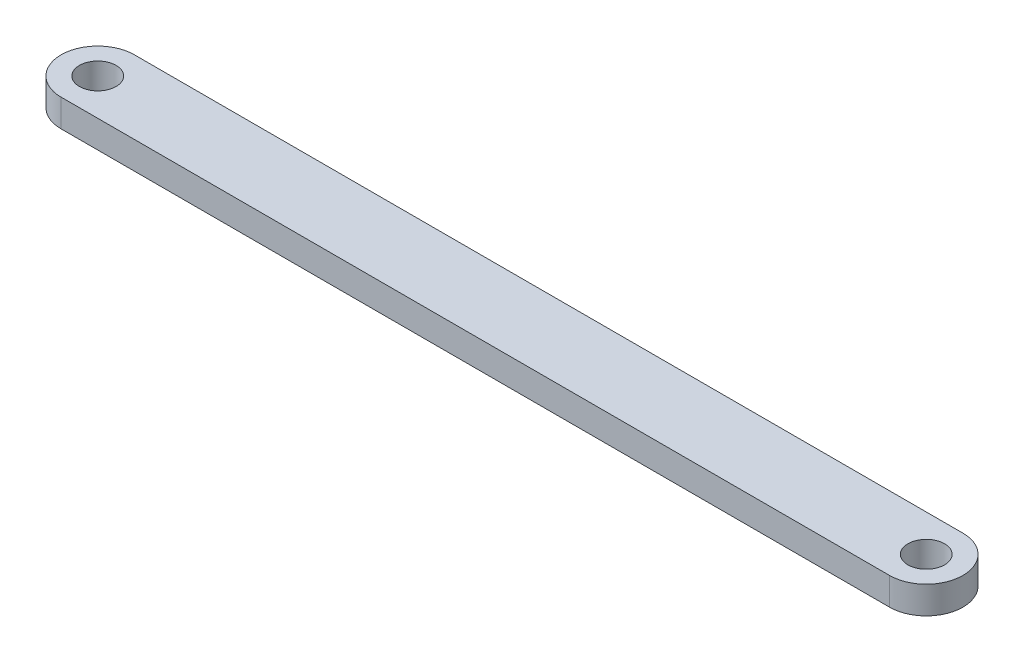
ISO-10303-21;
HEADER;
FILE_DESCRIPTION(('STEP AP214'),'2;1');
FILE_NAME('part.step','',(''),(''),'','','');
FILE_SCHEMA(('AUTOMOTIVE_DESIGN { 1 0 10303 214 1 1 1 1 }'));
ENDSEC;
DATA;
#1=APPLICATION_CONTEXT('core data for automotive mechanical design processes');
#2=APPLICATION_PROTOCOL_DEFINITION('international standard','automotive_design',2000,#1);
#3=PRODUCT_CONTEXT('',#1,'mechanical');
#4=PRODUCT('Part','Part','',(#3));
#5=PRODUCT_RELATED_PRODUCT_CATEGORY('part','',(#4));
#6=PRODUCT_DEFINITION_FORMATION('','',#4);
#7=PRODUCT_DEFINITION_CONTEXT('part definition',#1,'design');
#8=PRODUCT_DEFINITION('design','',#6,#7);
#9=PRODUCT_DEFINITION_SHAPE('','',#8);
#10=(LENGTH_UNIT() NAMED_UNIT(*) SI_UNIT(.MILLI.,.METRE.));
#11=(NAMED_UNIT(*) PLANE_ANGLE_UNIT() SI_UNIT($,.RADIAN.));
#12=(NAMED_UNIT(*) SI_UNIT($,.STERADIAN.) SOLID_ANGLE_UNIT());
#13=UNCERTAINTY_MEASURE_WITH_UNIT(LENGTH_MEASURE(1.E-05),#10,'distance_accuracy_value','');
#14=(GEOMETRIC_REPRESENTATION_CONTEXT(3) GLOBAL_UNCERTAINTY_ASSIGNED_CONTEXT((#13)) GLOBAL_UNIT_ASSIGNED_CONTEXT((#10,
#11,#12)) REPRESENTATION_CONTEXT('',''));
#15=CARTESIAN_POINT('',(0.,0.,0.));
#16=DIRECTION('',(0.,0.,1.));
#17=DIRECTION('',(1.,0.,0.));
#18=AXIS2_PLACEMENT_3D('',#15,#16,#17);
#19=CARTESIAN_POINT('',(-452.,15.,670.));
#20=DIRECTION('',(0.,1.,0.));
#21=DIRECTION('',(0.,0.,1.));
#22=AXIS2_PLACEMENT_3D('',#19,#20,#21);
#23=PLANE('',#22);
#24=CARTESIAN_POINT('',(-452.,15.,670.));
#25=DIRECTION('',(0.,1.,0.));
#26=DIRECTION('',(0.,0.,1.));
#27=AXIS2_PLACEMENT_3D('',#24,#25,#26);
#28=CIRCLE('',#27,9.99999999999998);
#29=CARTESIAN_POINT('',(-452.,15.,680.));
#30=VERTEX_POINT('',#29);
#31=EDGE_CURVE('E102',#30,#30,#28,.T.);
#32=ORIENTED_EDGE('',*,*,#31,.F.);
#33=EDGE_LOOP('',(#32));
#34=FACE_BOUND('',#33,.T.);
#35=CARTESIAN_POINT('',(-452.,15.,670.));
#36=DIRECTION('',(0.,1.,0.));
#37=DIRECTION('',(0.,0.,1.));
#38=AXIS2_PLACEMENT_3D('',#35,#36,#37);
#39=CIRCLE('',#38,20.);
#40=CARTESIAN_POINT('',(-452.,15.,650.));
#41=VERTEX_POINT('',#40);
#42=CARTESIAN_POINT('',(-452.,15.,690.));
#43=VERTEX_POINT('',#42);
#44=EDGE_CURVE('E87',#41,#43,#39,.T.);
#45=ORIENTED_EDGE('',*,*,#44,.T.);
#46=DIRECTION('',(1.,0.,0.));
#47=VECTOR('',#46,1.);
#48=CARTESIAN_POINT('',(-452.,15.,690.));
#49=LINE('',#48,#47);
#50=CARTESIAN_POINT('',(0.,15.,690.));
#51=VERTEX_POINT('',#50);
#52=EDGE_CURVE('E82',#43,#51,#49,.T.);
#53=ORIENTED_EDGE('',*,*,#52,.T.);
#54=CARTESIAN_POINT('',(0.,15.,670.));
#55=DIRECTION('',(0.,1.,0.));
#56=DIRECTION('',(0.,0.,1.));
#57=AXIS2_PLACEMENT_3D('',#54,#55,#56);
#58=CIRCLE('',#57,20.);
#59=CARTESIAN_POINT('',(0.,15.,650.));
#60=VERTEX_POINT('',#59);
#61=EDGE_CURVE('E85',#51,#60,#58,.T.);
#62=ORIENTED_EDGE('',*,*,#61,.T.);
#63=DIRECTION('',(-1.,0.,0.));
#64=VECTOR('',#63,1.);
#65=CARTESIAN_POINT('',(-452.,15.,650.));
#66=LINE('',#65,#64);
#67=EDGE_CURVE('E52',#60,#41,#66,.T.);
#68=ORIENTED_EDGE('',*,*,#67,.T.);
#69=EDGE_LOOP('',(#45,#53,#62,#68));
#70=FACE_BOUND('',#69,.T.);
#71=CARTESIAN_POINT('',(0.,15.,670.));
#72=DIRECTION('',(0.,1.,0.));
#73=DIRECTION('',(0.,0.,1.));
#74=AXIS2_PLACEMENT_3D('',#71,#72,#73);
#75=CIRCLE('',#74,10.);
#76=CARTESIAN_POINT('',(0.,15.,680.));
#77=VERTEX_POINT('',#76);
#78=EDGE_CURVE('E117',#77,#77,#75,.T.);
#79=ORIENTED_EDGE('',*,*,#78,.F.);
#80=EDGE_LOOP('',(#79));
#81=FACE_BOUND('',#80,.T.);
#82=ADVANCED_FACE('F35',(#34,#70,#81),#23,.T.);
#83=CARTESIAN_POINT('',(-452.,0.,670.));
#84=DIRECTION('',(0.,1.,0.));
#85=DIRECTION('',(0.,0.,1.));
#86=AXIS2_PLACEMENT_3D('',#83,#84,#85);
#87=PLANE('',#86);
#88=CARTESIAN_POINT('',(-452.,0.,670.));
#89=DIRECTION('',(0.,1.,0.));
#90=DIRECTION('',(0.,0.,1.));
#91=AXIS2_PLACEMENT_3D('',#88,#89,#90);
#92=CIRCLE('',#91,20.);
#93=CARTESIAN_POINT('',(-452.,0.,650.));
#94=VERTEX_POINT('',#93);
#95=CARTESIAN_POINT('',(-452.,0.,690.));
#96=VERTEX_POINT('',#95);
#97=EDGE_CURVE('E99',#94,#96,#92,.T.);
#98=ORIENTED_EDGE('',*,*,#97,.F.);
#99=DIRECTION('',(-1.,0.,0.));
#100=VECTOR('',#99,1.);
#101=CARTESIAN_POINT('',(-452.,0.,650.));
#102=LINE('',#101,#100);
#103=CARTESIAN_POINT('',(0.,0.,650.));
#104=VERTEX_POINT('',#103);
#105=EDGE_CURVE('E75',#104,#94,#102,.T.);
#106=ORIENTED_EDGE('',*,*,#105,.F.);
#107=CARTESIAN_POINT('',(0.,0.,670.));
#108=DIRECTION('',(0.,1.,0.));
#109=DIRECTION('',(0.,0.,1.));
#110=AXIS2_PLACEMENT_3D('',#107,#108,#109);
#111=CIRCLE('',#110,20.);
#112=CARTESIAN_POINT('',(0.,0.,690.));
#113=VERTEX_POINT('',#112);
#114=EDGE_CURVE('E69',#113,#104,#111,.T.);
#115=ORIENTED_EDGE('',*,*,#114,.F.);
#116=DIRECTION('',(1.,0.,0.));
#117=VECTOR('',#116,1.);
#118=CARTESIAN_POINT('',(-452.,0.,690.));
#119=LINE('',#118,#117);
#120=EDGE_CURVE('E91',#96,#113,#119,.T.);
#121=ORIENTED_EDGE('',*,*,#120,.F.);
#122=EDGE_LOOP('',(#98,#106,#115,#121));
#123=FACE_BOUND('',#122,.T.);
#124=CARTESIAN_POINT('',(-452.,0.,670.));
#125=DIRECTION('',(0.,1.,0.));
#126=DIRECTION('',(0.,0.,1.));
#127=AXIS2_PLACEMENT_3D('',#124,#125,#126);
#128=CIRCLE('',#127,9.99999999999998);
#129=CARTESIAN_POINT('',(-452.,0.,680.));
#130=VERTEX_POINT('',#129);
#131=EDGE_CURVE('E114',#130,#130,#128,.T.);
#132=ORIENTED_EDGE('',*,*,#131,.T.);
#133=EDGE_LOOP('',(#132));
#134=FACE_BOUND('',#133,.T.);
#135=CARTESIAN_POINT('',(0.,0.,670.));
#136=DIRECTION('',(0.,1.,0.));
#137=DIRECTION('',(0.,0.,1.));
#138=AXIS2_PLACEMENT_3D('',#135,#136,#137);
#139=CIRCLE('',#138,10.);
#140=CARTESIAN_POINT('',(0.,0.,680.));
#141=VERTEX_POINT('',#140);
#142=EDGE_CURVE('E120',#141,#141,#139,.T.);
#143=ORIENTED_EDGE('',*,*,#142,.T.);
#144=EDGE_LOOP('',(#143));
#145=FACE_BOUND('',#144,.T.);
#146=ADVANCED_FACE('F110',(#123,#134,#145),#87,.F.);
#147=CARTESIAN_POINT('',(-452.,15.,670.));
#148=DIRECTION('',(0.,-1.,0.));
#149=DIRECTION('',(0.,0.,-1.));
#150=AXIS2_PLACEMENT_3D('',#147,#148,#149);
#151=CYLINDRICAL_SURFACE('',#150,20.);
#152=ORIENTED_EDGE('',*,*,#97,.T.);
#153=DIRECTION('',(0.,-1.,0.));
#154=VECTOR('',#153,1.);
#155=CARTESIAN_POINT('',(-452.,15.,690.));
#156=LINE('',#155,#154);
#157=EDGE_CURVE('E11',#43,#96,#156,.T.);
#158=ORIENTED_EDGE('',*,*,#157,.F.);
#159=ORIENTED_EDGE('',*,*,#44,.F.);
#160=DIRECTION('',(0.,-1.,0.));
#161=VECTOR('',#160,1.);
#162=CARTESIAN_POINT('',(-452.,15.,650.));
#163=LINE('',#162,#161);
#164=EDGE_CURVE('E95',#41,#94,#163,.T.);
#165=ORIENTED_EDGE('',*,*,#164,.T.);
#166=EDGE_LOOP('',(#152,#158,#159,#165));
#167=FACE_BOUND('',#166,.T.);
#168=ADVANCED_FACE('F37',(#167),#151,.T.);
#169=CARTESIAN_POINT('',(-452.,15.,690.));
#170=DIRECTION('',(0.,0.,-1.));
#171=DIRECTION('',(-1.,0.,0.));
#172=AXIS2_PLACEMENT_3D('',#169,#170,#171);
#173=PLANE('',#172);
#174=ORIENTED_EDGE('',*,*,#120,.T.);
#175=DIRECTION('',(0.,-1.,0.));
#176=VECTOR('',#175,1.);
#177=CARTESIAN_POINT('',(0.,15.,690.));
#178=LINE('',#177,#176);
#179=EDGE_CURVE('E44',#51,#113,#178,.T.);
#180=ORIENTED_EDGE('',*,*,#179,.F.);
#181=ORIENTED_EDGE('',*,*,#52,.F.);
#182=ORIENTED_EDGE('',*,*,#157,.T.);
#183=EDGE_LOOP('',(#174,#180,#181,#182));
#184=FACE_BOUND('',#183,.T.);
#185=ADVANCED_FACE('F90',(#184),#173,.F.);
#186=CARTESIAN_POINT('',(0.,15.,670.));
#187=DIRECTION('',(0.,-1.,0.));
#188=DIRECTION('',(0.,0.,-1.));
#189=AXIS2_PLACEMENT_3D('',#186,#187,#188);
#190=CYLINDRICAL_SURFACE('',#189,20.);
#191=ORIENTED_EDGE('',*,*,#114,.T.);
#192=DIRECTION('',(0.,-1.,0.));
#193=VECTOR('',#192,1.);
#194=CARTESIAN_POINT('',(0.,15.,650.));
#195=LINE('',#194,#193);
#196=EDGE_CURVE('E92',#60,#104,#195,.T.);
#197=ORIENTED_EDGE('',*,*,#196,.F.);
#198=ORIENTED_EDGE('',*,*,#61,.F.);
#199=ORIENTED_EDGE('',*,*,#179,.T.);
#200=EDGE_LOOP('',(#191,#197,#198,#199));
#201=FACE_BOUND('',#200,.T.);
#202=ADVANCED_FACE('F93',(#201),#190,.T.);
#203=CARTESIAN_POINT('',(-452.,15.,650.));
#204=DIRECTION('',(0.,0.,1.));
#205=DIRECTION('',(1.,0.,0.));
#206=AXIS2_PLACEMENT_3D('',#203,#204,#205);
#207=PLANE('',#206);
#208=ORIENTED_EDGE('',*,*,#105,.T.);
#209=ORIENTED_EDGE('',*,*,#164,.F.);
#210=ORIENTED_EDGE('',*,*,#67,.F.);
#211=ORIENTED_EDGE('',*,*,#196,.T.);
#212=EDGE_LOOP('',(#208,#209,#210,#211));
#213=FACE_BOUND('',#212,.T.);
#214=ADVANCED_FACE('F107',(#213),#207,.F.);
#215=CARTESIAN_POINT('',(-452.,15.,670.));
#216=DIRECTION('',(0.,-1.,0.));
#217=DIRECTION('',(0.,0.,-1.));
#218=AXIS2_PLACEMENT_3D('',#215,#216,#217);
#219=CYLINDRICAL_SURFACE('',#218,9.99999999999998);
#220=ORIENTED_EDGE('',*,*,#31,.T.);
#221=EDGE_LOOP('',(#220));
#222=FACE_BOUND('',#221,.T.);
#223=ORIENTED_EDGE('',*,*,#131,.F.);
#224=EDGE_LOOP('',(#223));
#225=FACE_BOUND('',#224,.T.);
#226=ADVANCED_FACE('F137',(#222,#225),#219,.F.);
#227=CARTESIAN_POINT('',(0.,15.,670.));
#228=DIRECTION('',(0.,-1.,0.));
#229=DIRECTION('',(0.,0.,-1.));
#230=AXIS2_PLACEMENT_3D('',#227,#228,#229);
#231=CYLINDRICAL_SURFACE('',#230,10.);
#232=ORIENTED_EDGE('',*,*,#78,.T.);
#233=EDGE_LOOP('',(#232));
#234=FACE_BOUND('',#233,.T.);
#235=ORIENTED_EDGE('',*,*,#142,.F.);
#236=EDGE_LOOP('',(#235));
#237=FACE_BOUND('',#236,.T.);
#238=ADVANCED_FACE('F126',(#234,#237),#231,.F.);
#239=CLOSED_SHELL('',(#82,#146,#168,#185,#202,#214,#226,#238));
#240=MANIFOLD_SOLID_BREP('B2',#239);
#241=ADVANCED_BREP_SHAPE_REPRESENTATION('',(#18,#240),#14);
#242=SHAPE_DEFINITION_REPRESENTATION(#9,#241);
ENDSEC;
END-ISO-10303-21;
